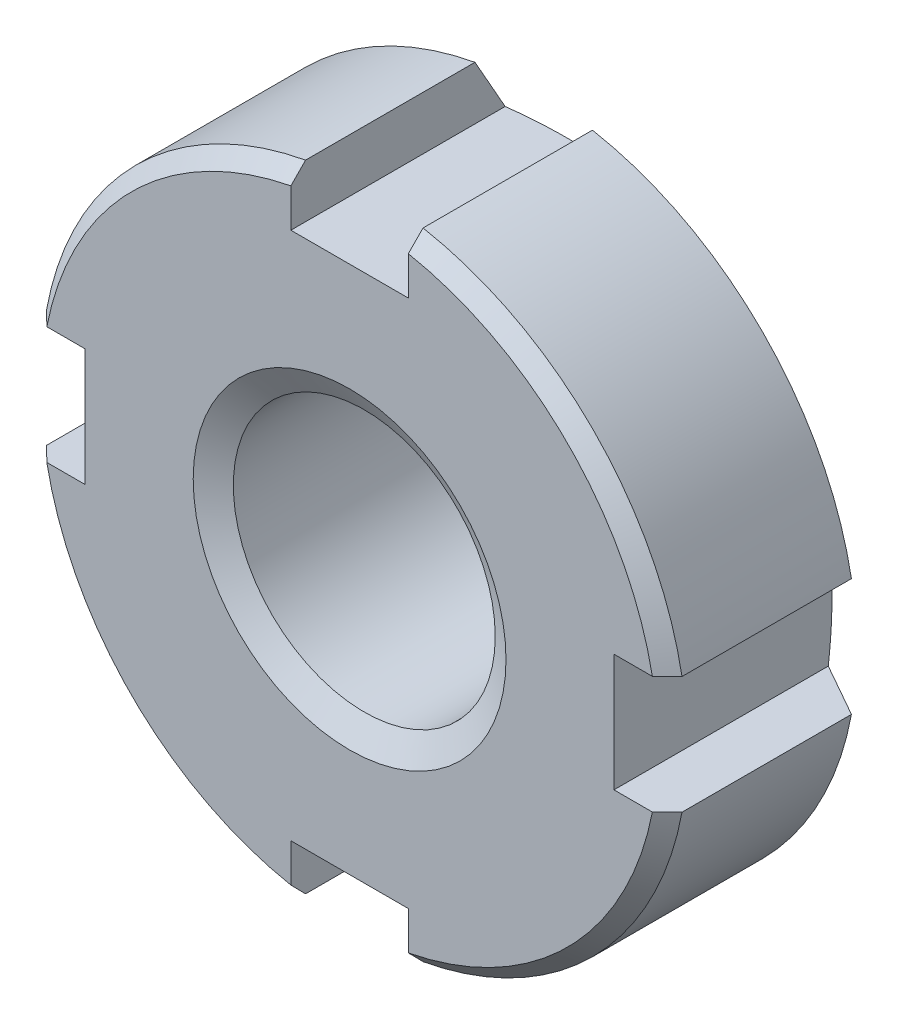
from build123d import *

# Parameters (mm, degrees)
SKETCH1_R        = 11
SKETCH1_R_2      = 4.4585
BASENUT_DEPTH    = 8
CHAMFER1_SIZE    = 0.5
ENDCHAMFER_SIZE  = 0.866025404
ENDCHAMFER_SIZE2 = 0.5
CHAMFER2_SIZE    = 0.7
SLOTCUT_DEPTH    = 23.467199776
SLOTPAT_COUNT    = 4


with BuildPart() as part:
    # Sketch1 → BaseNut (new body)
    with BuildSketch(Plane.XY):
        Circle(SKETCH1_R)
        Circle(SKETCH1_R_2, mode=Mode.SUBTRACT)
    extrude(amount=-BASENUT_DEPTH)

    # Sketch2 → StepCut (revolve, cut)
    with BuildSketch(Plane(origin=(0, 0, 0), x_dir=(1, 0, 0), z_dir=(0, 1, 0)), mode=Mode.PRIVATE) as stepcut_sk:
        Polygon((-11, 8), (-8, 8), (-11, 6.267949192), align=None)
    revolve(stepcut_sk.sketch.rotate(Axis((0, 0, -4.560481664), (0, 0, 1)), 180), axis=Axis((0, 0, -4.560481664), (0, 0, 1)), mode=Mode.SUBTRACT)

    # Chamfer1
    chamfer1_edges = [part.edges().sort_by_distance(p)[0] for p in [
        (-11, 0, 0),
    ]]
    chamfer(chamfer1_edges, length=CHAMFER1_SIZE)

    # EndChamfer
    endchamfer_edges = [part.edges().sort_by_distance(p)[0] for p in [
        (-4.4585, 0, 0),
    ]]
    endchamfer_side = [part.faces().sort_by_distance(p)[0] for p in [
        (-10.203015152, 0, 0),
    ]]
    chamfer(endchamfer_edges, length=ENDCHAMFER_SIZE, length2=ENDCHAMFER_SIZE2, reference=endchamfer_side[0])

    # Chamfer2
    chamfer2_edges = [part.edges().sort_by_distance(p)[0] for p in [
        (-4.4585, 0, -8),
    ]]
    chamfer(chamfer2_edges, length=CHAMFER2_SIZE)

    # Sketch3 → SlotCut (cut, through all)
    with BuildSketch(Plane(origin=(-3.554280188, 4.131027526, -8), x_dir=(-1, 0, 0), z_dir=(0, 0, -1))):
        with BuildLine():
            Line((-5.554280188, -13.131027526), (-1.554280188, -13.131027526))
            Line((-1.554280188, -13.131027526), (-1.554280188, -14.947681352))
            ThreePointArc((-1.554280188, -14.947681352), (-3.554280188, -15.131027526), (-5.554280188, -14.947681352))
            Line((-5.554280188, -14.947681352), (-5.554280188, -13.131027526))
        make_face()
    slotcut = extrude(amount=-SLOTCUT_DEPTH, mode=Mode.SUBTRACT)

    # SlotPat: SlotCut ×4 about axis
    slotpat_axis = Axis((0, 0, -4.560481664), (0, 0, 1))
    for i in range(1, SLOTPAT_COUNT):
        add(slotcut.rotate(slotpat_axis, i * 360 / SLOTPAT_COUNT), mode=Mode.SUBTRACT)


solid = part.part
